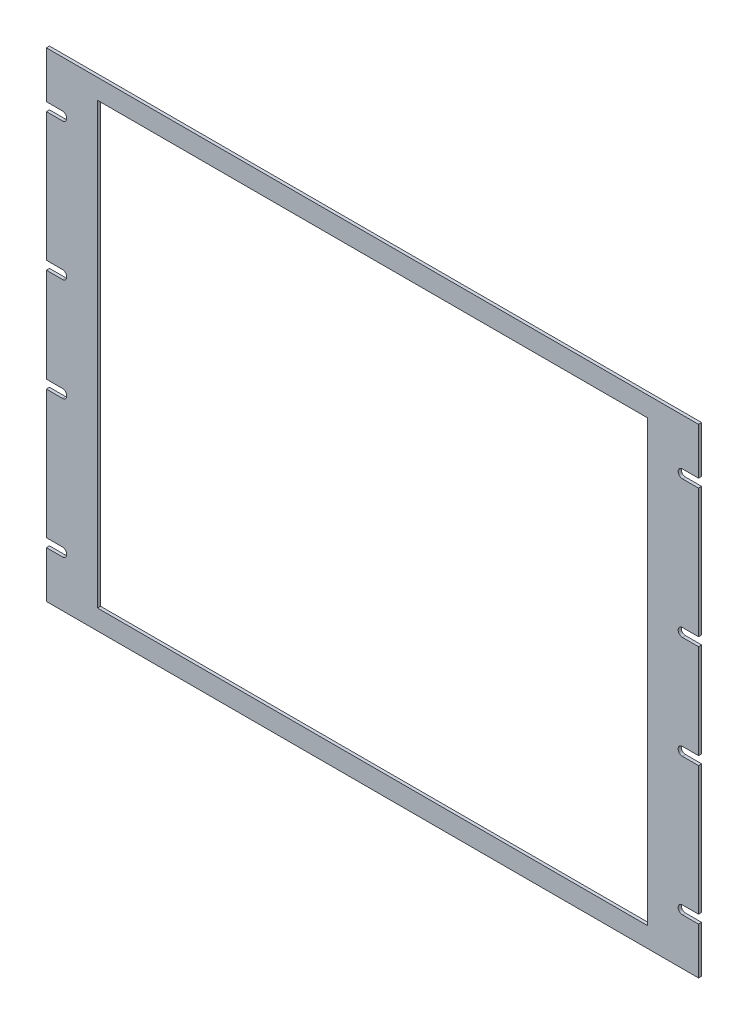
ISO-10303-21;
HEADER;
FILE_DESCRIPTION(('STEP AP214'),'2;1');
FILE_NAME('part.step','',(''),(''),'','','');
FILE_SCHEMA(('AUTOMOTIVE_DESIGN { 1 0 10303 214 1 1 1 1 }'));
ENDSEC;
DATA;
#1=APPLICATION_CONTEXT('core data for automotive mechanical design processes');
#2=APPLICATION_PROTOCOL_DEFINITION('international standard','automotive_design',2000,#1);
#3=PRODUCT_CONTEXT('',#1,'mechanical');
#4=PRODUCT('Part','Part','',(#3));
#5=PRODUCT_RELATED_PRODUCT_CATEGORY('part','',(#4));
#6=PRODUCT_DEFINITION_FORMATION('','',#4);
#7=PRODUCT_DEFINITION_CONTEXT('part definition',#1,'design');
#8=PRODUCT_DEFINITION('design','',#6,#7);
#9=PRODUCT_DEFINITION_SHAPE('','',#8);
#10=(LENGTH_UNIT() NAMED_UNIT(*) SI_UNIT(.MILLI.,.METRE.));
#11=(NAMED_UNIT(*) PLANE_ANGLE_UNIT() SI_UNIT($,.RADIAN.));
#12=(NAMED_UNIT(*) SI_UNIT($,.STERADIAN.) SOLID_ANGLE_UNIT());
#13=UNCERTAINTY_MEASURE_WITH_UNIT(LENGTH_MEASURE(1.E-05),#10,'distance_accuracy_value','');
#14=(GEOMETRIC_REPRESENTATION_CONTEXT(3) GLOBAL_UNCERTAINTY_ASSIGNED_CONTEXT((#13)) GLOBAL_UNIT_ASSIGNED_CONTEXT((#10,
#11,#12)) REPRESENTATION_CONTEXT('',''));
#15=CARTESIAN_POINT('',(0.,0.,0.));
#16=DIRECTION('',(0.,0.,1.));
#17=DIRECTION('',(1.,0.,0.));
#18=AXIS2_PLACEMENT_3D('',#15,#16,#17);
#19=CARTESIAN_POINT('',(229.3874,139.7,2.286));
#20=DIRECTION('',(0.,0.,1.));
#21=DIRECTION('',(1.,0.,0.));
#22=AXIS2_PLACEMENT_3D('',#19,#20,#21);
#23=PLANE('',#22);
#24=CARTESIAN_POINT('',(229.3874,139.7,2.286));
#25=DIRECTION('',(0.,0.,-1.));
#26=DIRECTION('',(1.,0.,0.));
#27=AXIS2_PLACEMENT_3D('',#24,#25,#26);
#28=CIRCLE('',#27,3.17499999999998);
#29=CARTESIAN_POINT('',(229.3874,136.525,2.286));
#30=VERTEX_POINT('',#29);
#31=CARTESIAN_POINT('',(229.3874,142.875,2.286));
#32=VERTEX_POINT('',#31);
#33=EDGE_CURVE('E326',#30,#32,#28,.T.);
#34=ORIENTED_EDGE('',*,*,#33,.T.);
#35=DIRECTION('',(1.,0.,0.));
#36=VECTOR('',#35,1.);
#37=CARTESIAN_POINT('',(241.3,142.875,2.286));
#38=LINE('',#37,#36);
#39=CARTESIAN_POINT('',(241.3,142.875,2.286));
#40=VERTEX_POINT('',#39);
#41=EDGE_CURVE('E329',#32,#40,#38,.T.);
#42=ORIENTED_EDGE('',*,*,#41,.T.);
#43=DIRECTION('',(0.,1.,0.));
#44=VECTOR('',#43,1.);
#45=CARTESIAN_POINT('',(241.3,177.419,2.286));
#46=LINE('',#45,#44);
#47=CARTESIAN_POINT('',(241.3,177.419,2.286));
#48=VERTEX_POINT('',#47);
#49=EDGE_CURVE('E332',#40,#48,#46,.T.);
#50=ORIENTED_EDGE('',*,*,#49,.T.);
#51=DIRECTION('',(-1.,0.,0.));
#52=VECTOR('',#51,1.);
#53=CARTESIAN_POINT('',(241.3,177.419,2.286));
#54=LINE('',#53,#52);
#55=CARTESIAN_POINT('',(-241.3,177.419,2.286));
#56=VERTEX_POINT('',#55);
#57=EDGE_CURVE('E334',#48,#56,#54,.T.);
#58=ORIENTED_EDGE('',*,*,#57,.T.);
#59=DIRECTION('',(0.,-1.,0.));
#60=VECTOR('',#59,1.);
#61=CARTESIAN_POINT('',(-241.3,177.419,2.286));
#62=LINE('',#61,#60);
#63=CARTESIAN_POINT('',(-241.3,142.875,2.286));
#64=VERTEX_POINT('',#63);
#65=EDGE_CURVE('E336',#56,#64,#62,.T.);
#66=ORIENTED_EDGE('',*,*,#65,.T.);
#67=DIRECTION('',(1.,0.,0.));
#68=VECTOR('',#67,1.);
#69=CARTESIAN_POINT('',(-241.3,142.875,2.286));
#70=LINE('',#69,#68);
#71=CARTESIAN_POINT('',(-229.3874,142.875,2.286));
#72=VERTEX_POINT('',#71);
#73=EDGE_CURVE('E338',#64,#72,#70,.T.);
#74=ORIENTED_EDGE('',*,*,#73,.T.);
#75=CARTESIAN_POINT('',(-229.3874,139.7,2.286));
#76=DIRECTION('',(0.,0.,-1.));
#77=DIRECTION('',(1.,0.,0.));
#78=AXIS2_PLACEMENT_3D('',#75,#76,#77);
#79=CIRCLE('',#78,3.17499999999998);
#80=CARTESIAN_POINT('',(-229.3874,136.525,2.286));
#81=VERTEX_POINT('',#80);
#82=EDGE_CURVE('E340',#72,#81,#79,.T.);
#83=ORIENTED_EDGE('',*,*,#82,.T.);
#84=DIRECTION('',(-1.,0.,0.));
#85=VECTOR('',#84,1.);
#86=CARTESIAN_POINT('',(-241.3,136.525,2.286));
#87=LINE('',#86,#85);
#88=CARTESIAN_POINT('',(-241.3,136.525,2.286));
#89=VERTEX_POINT('',#88);
#90=EDGE_CURVE('E342',#81,#89,#87,.T.);
#91=ORIENTED_EDGE('',*,*,#90,.T.);
#92=DIRECTION('',(0.,-1.,0.));
#93=VECTOR('',#92,1.);
#94=CARTESIAN_POINT('',(-241.3,136.525,2.286));
#95=LINE('',#94,#93);
#96=CARTESIAN_POINT('',(-241.3,41.2749746,2.286));
#97=VERTEX_POINT('',#96);
#98=EDGE_CURVE('E344',#89,#97,#95,.T.);
#99=ORIENTED_EDGE('',*,*,#98,.T.);
#100=DIRECTION('',(1.,0.,0.));
#101=VECTOR('',#100,1.);
#102=CARTESIAN_POINT('',(-241.3,41.2749746,2.286));
#103=LINE('',#102,#101);
#104=CARTESIAN_POINT('',(-229.3874,41.2749746,2.286));
#105=VERTEX_POINT('',#104);
#106=EDGE_CURVE('E346',#97,#105,#103,.T.);
#107=ORIENTED_EDGE('',*,*,#106,.T.);
#108=CARTESIAN_POINT('',(-229.3874,38.0999746,2.286));
#109=DIRECTION('',(0.,0.,-1.));
#110=DIRECTION('',(1.,0.,0.));
#111=AXIS2_PLACEMENT_3D('',#108,#109,#110);
#112=CIRCLE('',#111,3.175);
#113=CARTESIAN_POINT('',(-229.3874,34.9249746,2.286));
#114=VERTEX_POINT('',#113);
#115=EDGE_CURVE('E348',#105,#114,#112,.T.);
#116=ORIENTED_EDGE('',*,*,#115,.T.);
#117=DIRECTION('',(-1.,0.,0.));
#118=VECTOR('',#117,1.);
#119=CARTESIAN_POINT('',(-241.3,34.9249746,2.286));
#120=LINE('',#119,#118);
#121=CARTESIAN_POINT('',(-241.3,34.9249746,2.286));
#122=VERTEX_POINT('',#121);
#123=EDGE_CURVE('E350',#114,#122,#120,.T.);
#124=ORIENTED_EDGE('',*,*,#123,.T.);
#125=DIRECTION('',(0.,-1.,0.));
#126=VECTOR('',#125,1.);
#127=CARTESIAN_POINT('',(-241.3,34.9249746,2.286));
#128=LINE('',#127,#126);
#129=CARTESIAN_POINT('',(-241.3,-34.925,2.286));
#130=VERTEX_POINT('',#129);
#131=EDGE_CURVE('E352',#122,#130,#128,.T.);
#132=ORIENTED_EDGE('',*,*,#131,.T.);
#133=DIRECTION('',(1.,0.,0.));
#134=VECTOR('',#133,1.);
#135=CARTESIAN_POINT('',(-241.3,-34.925,2.286));
#136=LINE('',#135,#134);
#137=CARTESIAN_POINT('',(-229.3874,-34.925,2.286));
#138=VERTEX_POINT('',#137);
#139=EDGE_CURVE('E354',#130,#138,#136,.T.);
#140=ORIENTED_EDGE('',*,*,#139,.T.);
#141=CARTESIAN_POINT('',(-229.3874,-38.1,2.286));
#142=DIRECTION('',(0.,0.,-1.));
#143=DIRECTION('',(1.,0.,0.));
#144=AXIS2_PLACEMENT_3D('',#141,#142,#143);
#145=CIRCLE('',#144,3.175);
#146=CARTESIAN_POINT('',(-229.3874,-41.275,2.286));
#147=VERTEX_POINT('',#146);
#148=EDGE_CURVE('E356',#138,#147,#145,.T.);
#149=ORIENTED_EDGE('',*,*,#148,.T.);
#150=DIRECTION('',(-1.,0.,0.));
#151=VECTOR('',#150,1.);
#152=CARTESIAN_POINT('',(-241.3,-41.275,2.286));
#153=LINE('',#152,#151);
#154=CARTESIAN_POINT('',(-241.3,-41.275,2.286));
#155=VERTEX_POINT('',#154);
#156=EDGE_CURVE('E358',#147,#155,#153,.T.);
#157=ORIENTED_EDGE('',*,*,#156,.T.);
#158=DIRECTION('',(0.,-1.,0.));
#159=VECTOR('',#158,1.);
#160=CARTESIAN_POINT('',(-241.3,-41.275,2.286));
#161=LINE('',#160,#159);
#162=CARTESIAN_POINT('',(-241.3,-136.525,2.286));
#163=VERTEX_POINT('',#162);
#164=EDGE_CURVE('E360',#155,#163,#161,.T.);
#165=ORIENTED_EDGE('',*,*,#164,.T.);
#166=DIRECTION('',(1.,0.,0.));
#167=VECTOR('',#166,1.);
#168=CARTESIAN_POINT('',(-241.3,-136.525,2.286));
#169=LINE('',#168,#167);
#170=CARTESIAN_POINT('',(-229.3874,-136.525,2.286));
#171=VERTEX_POINT('',#170);
#172=EDGE_CURVE('E362',#163,#171,#169,.T.);
#173=ORIENTED_EDGE('',*,*,#172,.T.);
#174=CARTESIAN_POINT('',(-229.3874,-139.7,2.286));
#175=DIRECTION('',(0.,0.,-1.));
#176=DIRECTION('',(1.,0.,0.));
#177=AXIS2_PLACEMENT_3D('',#174,#175,#176);
#178=CIRCLE('',#177,3.17500000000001);
#179=CARTESIAN_POINT('',(-229.3874,-142.875,2.286));
#180=VERTEX_POINT('',#179);
#181=EDGE_CURVE('E364',#171,#180,#178,.T.);
#182=ORIENTED_EDGE('',*,*,#181,.T.);
#183=DIRECTION('',(-1.,0.,0.));
#184=VECTOR('',#183,1.);
#185=CARTESIAN_POINT('',(-241.3,-142.875,2.286));
#186=LINE('',#185,#184);
#187=CARTESIAN_POINT('',(-241.3,-142.875,2.286));
#188=VERTEX_POINT('',#187);
#189=EDGE_CURVE('E366',#180,#188,#186,.T.);
#190=ORIENTED_EDGE('',*,*,#189,.T.);
#191=DIRECTION('',(0.,-1.,0.));
#192=VECTOR('',#191,1.);
#193=CARTESIAN_POINT('',(-241.3,-177.3936,2.286));
#194=LINE('',#193,#192);
#195=CARTESIAN_POINT('',(-241.3,-177.3936,2.286));
#196=VERTEX_POINT('',#195);
#197=EDGE_CURVE('E368',#188,#196,#194,.T.);
#198=ORIENTED_EDGE('',*,*,#197,.T.);
#199=DIRECTION('',(1.,0.,0.));
#200=VECTOR('',#199,1.);
#201=CARTESIAN_POINT('',(241.3,-177.3936,2.286));
#202=LINE('',#201,#200);
#203=CARTESIAN_POINT('',(241.3,-177.3936,2.286));
#204=VERTEX_POINT('',#203);
#205=EDGE_CURVE('E370',#196,#204,#202,.T.);
#206=ORIENTED_EDGE('',*,*,#205,.T.);
#207=DIRECTION('',(0.,1.,0.));
#208=VECTOR('',#207,1.);
#209=CARTESIAN_POINT('',(241.3,-177.3936,2.286));
#210=LINE('',#209,#208);
#211=CARTESIAN_POINT('',(241.3,-142.875,2.286));
#212=VERTEX_POINT('',#211);
#213=EDGE_CURVE('E372',#204,#212,#210,.T.);
#214=ORIENTED_EDGE('',*,*,#213,.T.);
#215=DIRECTION('',(-1.,0.,0.));
#216=VECTOR('',#215,1.);
#217=CARTESIAN_POINT('',(241.3,-142.875,2.286));
#218=LINE('',#217,#216);
#219=CARTESIAN_POINT('',(229.3874,-142.875,2.286));
#220=VERTEX_POINT('',#219);
#221=EDGE_CURVE('E374',#212,#220,#218,.T.);
#222=ORIENTED_EDGE('',*,*,#221,.T.);
#223=CARTESIAN_POINT('',(229.3874,-139.7,2.286));
#224=DIRECTION('',(0.,0.,-1.));
#225=DIRECTION('',(1.,0.,0.));
#226=AXIS2_PLACEMENT_3D('',#223,#224,#225);
#227=CIRCLE('',#226,3.17500000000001);
#228=CARTESIAN_POINT('',(229.3874,-136.525,2.286));
#229=VERTEX_POINT('',#228);
#230=EDGE_CURVE('E376',#220,#229,#227,.T.);
#231=ORIENTED_EDGE('',*,*,#230,.T.);
#232=DIRECTION('',(1.,0.,0.));
#233=VECTOR('',#232,1.);
#234=CARTESIAN_POINT('',(241.3,-136.525,2.286));
#235=LINE('',#234,#233);
#236=CARTESIAN_POINT('',(241.3,-136.525,2.286));
#237=VERTEX_POINT('',#236);
#238=EDGE_CURVE('E378',#229,#237,#235,.T.);
#239=ORIENTED_EDGE('',*,*,#238,.T.);
#240=DIRECTION('',(0.,1.,0.));
#241=VECTOR('',#240,1.);
#242=CARTESIAN_POINT('',(241.3,-136.525,2.286));
#243=LINE('',#242,#241);
#244=CARTESIAN_POINT('',(241.3,-41.275,2.286));
#245=VERTEX_POINT('',#244);
#246=EDGE_CURVE('E380',#237,#245,#243,.T.);
#247=ORIENTED_EDGE('',*,*,#246,.T.);
#248=DIRECTION('',(-1.,0.,0.));
#249=VECTOR('',#248,1.);
#250=CARTESIAN_POINT('',(241.3,-41.275,2.286));
#251=LINE('',#250,#249);
#252=CARTESIAN_POINT('',(229.3874,-41.275,2.286));
#253=VERTEX_POINT('',#252);
#254=EDGE_CURVE('E382',#245,#253,#251,.T.);
#255=ORIENTED_EDGE('',*,*,#254,.T.);
#256=CARTESIAN_POINT('',(229.3874,-38.1,2.286));
#257=DIRECTION('',(0.,0.,-1.));
#258=DIRECTION('',(1.,0.,0.));
#259=AXIS2_PLACEMENT_3D('',#256,#257,#258);
#260=CIRCLE('',#259,3.175);
#261=CARTESIAN_POINT('',(229.3874,-34.925,2.286));
#262=VERTEX_POINT('',#261);
#263=EDGE_CURVE('E384',#253,#262,#260,.T.);
#264=ORIENTED_EDGE('',*,*,#263,.T.);
#265=DIRECTION('',(1.,0.,0.));
#266=VECTOR('',#265,1.);
#267=CARTESIAN_POINT('',(241.3,-34.925,2.286));
#268=LINE('',#267,#266);
#269=CARTESIAN_POINT('',(241.3,-34.925,2.286));
#270=VERTEX_POINT('',#269);
#271=EDGE_CURVE('E386',#262,#270,#268,.T.);
#272=ORIENTED_EDGE('',*,*,#271,.T.);
#273=DIRECTION('',(0.,1.,0.));
#274=VECTOR('',#273,1.);
#275=CARTESIAN_POINT('',(241.3,-34.925,2.286));
#276=LINE('',#275,#274);
#277=CARTESIAN_POINT('',(241.3,34.9249746,2.286));
#278=VERTEX_POINT('',#277);
#279=EDGE_CURVE('E388',#270,#278,#276,.T.);
#280=ORIENTED_EDGE('',*,*,#279,.T.);
#281=DIRECTION('',(-1.,0.,0.));
#282=VECTOR('',#281,1.);
#283=CARTESIAN_POINT('',(241.3,34.9249746,2.286));
#284=LINE('',#283,#282);
#285=CARTESIAN_POINT('',(229.3874,34.9249746,2.286));
#286=VERTEX_POINT('',#285);
#287=EDGE_CURVE('E390',#278,#286,#284,.T.);
#288=ORIENTED_EDGE('',*,*,#287,.T.);
#289=CARTESIAN_POINT('',(229.3874,38.0999746,2.286));
#290=DIRECTION('',(0.,0.,-1.));
#291=DIRECTION('',(1.,0.,0.));
#292=AXIS2_PLACEMENT_3D('',#289,#290,#291);
#293=CIRCLE('',#292,3.175);
#294=CARTESIAN_POINT('',(229.3874,41.2749746,2.286));
#295=VERTEX_POINT('',#294);
#296=EDGE_CURVE('E392',#286,#295,#293,.T.);
#297=ORIENTED_EDGE('',*,*,#296,.T.);
#298=DIRECTION('',(1.,0.,0.));
#299=VECTOR('',#298,1.);
#300=CARTESIAN_POINT('',(241.3,41.2749746,2.286));
#301=LINE('',#300,#299);
#302=CARTESIAN_POINT('',(241.3,41.2749746,2.286));
#303=VERTEX_POINT('',#302);
#304=EDGE_CURVE('E394',#295,#303,#301,.T.);
#305=ORIENTED_EDGE('',*,*,#304,.T.);
#306=DIRECTION('',(0.,1.,0.));
#307=VECTOR('',#306,1.);
#308=CARTESIAN_POINT('',(241.3,41.2749746,2.286));
#309=LINE('',#308,#307);
#310=CARTESIAN_POINT('',(241.3,136.525,2.286));
#311=VERTEX_POINT('',#310);
#312=EDGE_CURVE('E396',#303,#311,#309,.T.);
#313=ORIENTED_EDGE('',*,*,#312,.T.);
#314=DIRECTION('',(-1.,0.,0.));
#315=VECTOR('',#314,1.);
#316=CARTESIAN_POINT('',(241.3,136.525,2.286));
#317=LINE('',#316,#315);
#318=EDGE_CURVE('E398',#311,#30,#317,.T.);
#319=ORIENTED_EDGE('',*,*,#318,.T.);
#320=EDGE_LOOP('',(#34,#42,#50,#58,#66,#74,#83,#91,#99,#107,#116,#124,#132,#140,#149,#157,#165,
#173,#182,#190,#198,#206,#214,#222,#231,#239,#247,#255,#264,#272,#280,#288,#297,#305,#313,#319));
#321=FACE_BOUND('',#320,.T.);
#322=DIRECTION('',(-1.,0.,0.));
#323=VECTOR('',#322,1.);
#324=CARTESIAN_POINT('',(203.454,162.687,2.286));
#325=LINE('',#324,#323);
#326=CARTESIAN_POINT('',(203.454,162.687,2.286));
#327=VERTEX_POINT('',#326);
#328=CARTESIAN_POINT('',(-203.454,162.687,2.286));
#329=VERTEX_POINT('',#328);
#330=EDGE_CURVE('E298',#327,#329,#325,.T.);
#331=ORIENTED_EDGE('',*,*,#330,.F.);
#332=DIRECTION('',(0.,1.,0.));
#333=VECTOR('',#332,1.);
#334=CARTESIAN_POINT('',(203.454,162.687,2.286));
#335=LINE('',#334,#333);
#336=CARTESIAN_POINT('',(203.454,-162.687,2.286));
#337=VERTEX_POINT('',#336);
#338=EDGE_CURVE('E290',#337,#327,#335,.T.);
#339=ORIENTED_EDGE('',*,*,#338,.F.);
#340=DIRECTION('',(1.,0.,0.));
#341=VECTOR('',#340,1.);
#342=CARTESIAN_POINT('',(203.454,-162.687,2.286));
#343=LINE('',#342,#341);
#344=CARTESIAN_POINT('',(-203.454,-162.687,2.286));
#345=VERTEX_POINT('',#344);
#346=EDGE_CURVE('E312',#345,#337,#343,.T.);
#347=ORIENTED_EDGE('',*,*,#346,.F.);
#348=DIRECTION('',(0.,-1.,0.));
#349=VECTOR('',#348,1.);
#350=CARTESIAN_POINT('',(-203.454,162.687,2.286));
#351=LINE('',#350,#349);
#352=EDGE_CURVE('E310',#329,#345,#351,.T.);
#353=ORIENTED_EDGE('',*,*,#352,.F.);
#354=EDGE_LOOP('',(#331,#339,#347,#353));
#355=FACE_BOUND('',#354,.T.);
#356=ADVANCED_FACE('F33',(#321,#355),#23,.T.);
#357=CARTESIAN_POINT('',(229.3874,139.7,0.));
#358=DIRECTION('',(0.,0.,1.));
#359=DIRECTION('',(1.,0.,0.));
#360=AXIS2_PLACEMENT_3D('',#357,#358,#359);
#361=PLANE('',#360);
#362=CARTESIAN_POINT('',(229.3874,139.7,0.));
#363=DIRECTION('',(0.,0.,-1.));
#364=DIRECTION('',(1.,0.,0.));
#365=AXIS2_PLACEMENT_3D('',#362,#363,#364);
#366=CIRCLE('',#365,3.17499999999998);
#367=CARTESIAN_POINT('',(229.3874,136.525,0.));
#368=VERTEX_POINT('',#367);
#369=CARTESIAN_POINT('',(229.3874,142.875,0.));
#370=VERTEX_POINT('',#369);
#371=EDGE_CURVE('E306',#368,#370,#366,.T.);
#372=ORIENTED_EDGE('',*,*,#371,.F.);
#373=DIRECTION('',(-1.,0.,0.));
#374=VECTOR('',#373,1.);
#375=CARTESIAN_POINT('',(241.3,136.525,0.));
#376=LINE('',#375,#374);
#377=CARTESIAN_POINT('',(241.3,136.525,0.));
#378=VERTEX_POINT('',#377);
#379=EDGE_CURVE('E330',#378,#368,#376,.T.);
#380=ORIENTED_EDGE('',*,*,#379,.F.);
#381=DIRECTION('',(0.,1.,0.));
#382=VECTOR('',#381,1.);
#383=CARTESIAN_POINT('',(241.3,41.2749746,0.));
#384=LINE('',#383,#382);
#385=CARTESIAN_POINT('',(241.3,41.2749746,0.));
#386=VERTEX_POINT('',#385);
#387=EDGE_CURVE('E469',#386,#378,#384,.T.);
#388=ORIENTED_EDGE('',*,*,#387,.F.);
#389=DIRECTION('',(1.,0.,0.));
#390=VECTOR('',#389,1.);
#391=CARTESIAN_POINT('',(241.3,41.2749746,0.));
#392=LINE('',#391,#390);
#393=CARTESIAN_POINT('',(229.3874,41.2749746,0.));
#394=VERTEX_POINT('',#393);
#395=EDGE_CURVE('E467',#394,#386,#392,.T.);
#396=ORIENTED_EDGE('',*,*,#395,.F.);
#397=CARTESIAN_POINT('',(229.3874,38.0999746,0.));
#398=DIRECTION('',(0.,0.,-1.));
#399=DIRECTION('',(1.,0.,0.));
#400=AXIS2_PLACEMENT_3D('',#397,#398,#399);
#401=CIRCLE('',#400,3.175);
#402=CARTESIAN_POINT('',(229.3874,34.9249746,0.));
#403=VERTEX_POINT('',#402);
#404=EDGE_CURVE('E465',#403,#394,#401,.T.);
#405=ORIENTED_EDGE('',*,*,#404,.F.);
#406=DIRECTION('',(-1.,0.,0.));
#407=VECTOR('',#406,1.);
#408=CARTESIAN_POINT('',(241.3,34.9249746,0.));
#409=LINE('',#408,#407);
#410=CARTESIAN_POINT('',(241.3,34.9249746,0.));
#411=VERTEX_POINT('',#410);
#412=EDGE_CURVE('E463',#411,#403,#409,.T.);
#413=ORIENTED_EDGE('',*,*,#412,.F.);
#414=DIRECTION('',(0.,1.,0.));
#415=VECTOR('',#414,1.);
#416=CARTESIAN_POINT('',(241.3,-34.925,0.));
#417=LINE('',#416,#415);
#418=CARTESIAN_POINT('',(241.3,-34.925,0.));
#419=VERTEX_POINT('',#418);
#420=EDGE_CURVE('E461',#419,#411,#417,.T.);
#421=ORIENTED_EDGE('',*,*,#420,.F.);
#422=DIRECTION('',(1.,0.,0.));
#423=VECTOR('',#422,1.);
#424=CARTESIAN_POINT('',(241.3,-34.925,0.));
#425=LINE('',#424,#423);
#426=CARTESIAN_POINT('',(229.3874,-34.925,0.));
#427=VERTEX_POINT('',#426);
#428=EDGE_CURVE('E459',#427,#419,#425,.T.);
#429=ORIENTED_EDGE('',*,*,#428,.F.);
#430=CARTESIAN_POINT('',(229.3874,-38.1,0.));
#431=DIRECTION('',(0.,0.,-1.));
#432=DIRECTION('',(1.,0.,0.));
#433=AXIS2_PLACEMENT_3D('',#430,#431,#432);
#434=CIRCLE('',#433,3.175);
#435=CARTESIAN_POINT('',(229.3874,-41.275,0.));
#436=VERTEX_POINT('',#435);
#437=EDGE_CURVE('E457',#436,#427,#434,.T.);
#438=ORIENTED_EDGE('',*,*,#437,.F.);
#439=DIRECTION('',(-1.,0.,0.));
#440=VECTOR('',#439,1.);
#441=CARTESIAN_POINT('',(241.3,-41.275,0.));
#442=LINE('',#441,#440);
#443=CARTESIAN_POINT('',(241.3,-41.275,0.));
#444=VERTEX_POINT('',#443);
#445=EDGE_CURVE('E455',#444,#436,#442,.T.);
#446=ORIENTED_EDGE('',*,*,#445,.F.);
#447=DIRECTION('',(0.,1.,0.));
#448=VECTOR('',#447,1.);
#449=CARTESIAN_POINT('',(241.3,-136.525,0.));
#450=LINE('',#449,#448);
#451=CARTESIAN_POINT('',(241.3,-136.525,0.));
#452=VERTEX_POINT('',#451);
#453=EDGE_CURVE('E453',#452,#444,#450,.T.);
#454=ORIENTED_EDGE('',*,*,#453,.F.);
#455=DIRECTION('',(1.,0.,0.));
#456=VECTOR('',#455,1.);
#457=CARTESIAN_POINT('',(241.3,-136.525,0.));
#458=LINE('',#457,#456);
#459=CARTESIAN_POINT('',(229.3874,-136.525,0.));
#460=VERTEX_POINT('',#459);
#461=EDGE_CURVE('E451',#460,#452,#458,.T.);
#462=ORIENTED_EDGE('',*,*,#461,.F.);
#463=CARTESIAN_POINT('',(229.3874,-139.7,0.));
#464=DIRECTION('',(0.,0.,-1.));
#465=DIRECTION('',(1.,0.,0.));
#466=AXIS2_PLACEMENT_3D('',#463,#464,#465);
#467=CIRCLE('',#466,3.17500000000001);
#468=CARTESIAN_POINT('',(229.3874,-142.875,0.));
#469=VERTEX_POINT('',#468);
#470=EDGE_CURVE('E449',#469,#460,#467,.T.);
#471=ORIENTED_EDGE('',*,*,#470,.F.);
#472=DIRECTION('',(-1.,0.,0.));
#473=VECTOR('',#472,1.);
#474=CARTESIAN_POINT('',(241.3,-142.875,0.));
#475=LINE('',#474,#473);
#476=CARTESIAN_POINT('',(241.3,-142.875,0.));
#477=VERTEX_POINT('',#476);
#478=EDGE_CURVE('E447',#477,#469,#475,.T.);
#479=ORIENTED_EDGE('',*,*,#478,.F.);
#480=DIRECTION('',(0.,1.,0.));
#481=VECTOR('',#480,1.);
#482=CARTESIAN_POINT('',(241.3,-177.3936,0.));
#483=LINE('',#482,#481);
#484=CARTESIAN_POINT('',(241.3,-177.3936,0.));
#485=VERTEX_POINT('',#484);
#486=EDGE_CURVE('E445',#485,#477,#483,.T.);
#487=ORIENTED_EDGE('',*,*,#486,.F.);
#488=DIRECTION('',(1.,0.,0.));
#489=VECTOR('',#488,1.);
#490=CARTESIAN_POINT('',(241.3,-177.3936,0.));
#491=LINE('',#490,#489);
#492=CARTESIAN_POINT('',(-241.3,-177.3936,0.));
#493=VERTEX_POINT('',#492);
#494=EDGE_CURVE('E443',#493,#485,#491,.T.);
#495=ORIENTED_EDGE('',*,*,#494,.F.);
#496=DIRECTION('',(0.,-1.,0.));
#497=VECTOR('',#496,1.);
#498=CARTESIAN_POINT('',(-241.3,-177.3936,0.));
#499=LINE('',#498,#497);
#500=CARTESIAN_POINT('',(-241.3,-142.875,0.));
#501=VERTEX_POINT('',#500);
#502=EDGE_CURVE('E441',#501,#493,#499,.T.);
#503=ORIENTED_EDGE('',*,*,#502,.F.);
#504=DIRECTION('',(-1.,0.,0.));
#505=VECTOR('',#504,1.);
#506=CARTESIAN_POINT('',(-241.3,-142.875,0.));
#507=LINE('',#506,#505);
#508=CARTESIAN_POINT('',(-229.3874,-142.875,0.));
#509=VERTEX_POINT('',#508);
#510=EDGE_CURVE('E439',#509,#501,#507,.T.);
#511=ORIENTED_EDGE('',*,*,#510,.F.);
#512=CARTESIAN_POINT('',(-229.3874,-139.7,0.));
#513=DIRECTION('',(0.,0.,-1.));
#514=DIRECTION('',(1.,0.,0.));
#515=AXIS2_PLACEMENT_3D('',#512,#513,#514);
#516=CIRCLE('',#515,3.17500000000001);
#517=CARTESIAN_POINT('',(-229.3874,-136.525,0.));
#518=VERTEX_POINT('',#517);
#519=EDGE_CURVE('E437',#518,#509,#516,.T.);
#520=ORIENTED_EDGE('',*,*,#519,.F.);
#521=DIRECTION('',(1.,0.,0.));
#522=VECTOR('',#521,1.);
#523=CARTESIAN_POINT('',(-241.3,-136.525,0.));
#524=LINE('',#523,#522);
#525=CARTESIAN_POINT('',(-241.3,-136.525,0.));
#526=VERTEX_POINT('',#525);
#527=EDGE_CURVE('E435',#526,#518,#524,.T.);
#528=ORIENTED_EDGE('',*,*,#527,.F.);
#529=DIRECTION('',(0.,-1.,0.));
#530=VECTOR('',#529,1.);
#531=CARTESIAN_POINT('',(-241.3,-41.275,0.));
#532=LINE('',#531,#530);
#533=CARTESIAN_POINT('',(-241.3,-41.275,0.));
#534=VERTEX_POINT('',#533);
#535=EDGE_CURVE('E433',#534,#526,#532,.T.);
#536=ORIENTED_EDGE('',*,*,#535,.F.);
#537=DIRECTION('',(-1.,0.,0.));
#538=VECTOR('',#537,1.);
#539=CARTESIAN_POINT('',(-241.3,-41.275,0.));
#540=LINE('',#539,#538);
#541=CARTESIAN_POINT('',(-229.3874,-41.275,0.));
#542=VERTEX_POINT('',#541);
#543=EDGE_CURVE('E431',#542,#534,#540,.T.);
#544=ORIENTED_EDGE('',*,*,#543,.F.);
#545=CARTESIAN_POINT('',(-229.3874,-38.1,0.));
#546=DIRECTION('',(0.,0.,-1.));
#547=DIRECTION('',(1.,0.,0.));
#548=AXIS2_PLACEMENT_3D('',#545,#546,#547);
#549=CIRCLE('',#548,3.175);
#550=CARTESIAN_POINT('',(-229.3874,-34.925,0.));
#551=VERTEX_POINT('',#550);
#552=EDGE_CURVE('E429',#551,#542,#549,.T.);
#553=ORIENTED_EDGE('',*,*,#552,.F.);
#554=DIRECTION('',(1.,0.,0.));
#555=VECTOR('',#554,1.);
#556=CARTESIAN_POINT('',(-241.3,-34.925,0.));
#557=LINE('',#556,#555);
#558=CARTESIAN_POINT('',(-241.3,-34.925,0.));
#559=VERTEX_POINT('',#558);
#560=EDGE_CURVE('E427',#559,#551,#557,.T.);
#561=ORIENTED_EDGE('',*,*,#560,.F.);
#562=DIRECTION('',(0.,-1.,0.));
#563=VECTOR('',#562,1.);
#564=CARTESIAN_POINT('',(-241.3,34.9249746,0.));
#565=LINE('',#564,#563);
#566=CARTESIAN_POINT('',(-241.3,34.9249746,0.));
#567=VERTEX_POINT('',#566);
#568=EDGE_CURVE('E425',#567,#559,#565,.T.);
#569=ORIENTED_EDGE('',*,*,#568,.F.);
#570=DIRECTION('',(-1.,0.,0.));
#571=VECTOR('',#570,1.);
#572=CARTESIAN_POINT('',(-241.3,34.9249746,0.));
#573=LINE('',#572,#571);
#574=CARTESIAN_POINT('',(-229.3874,34.9249746,0.));
#575=VERTEX_POINT('',#574);
#576=EDGE_CURVE('E423',#575,#567,#573,.T.);
#577=ORIENTED_EDGE('',*,*,#576,.F.);
#578=CARTESIAN_POINT('',(-229.3874,38.0999746,0.));
#579=DIRECTION('',(0.,0.,-1.));
#580=DIRECTION('',(1.,0.,0.));
#581=AXIS2_PLACEMENT_3D('',#578,#579,#580);
#582=CIRCLE('',#581,3.175);
#583=CARTESIAN_POINT('',(-229.3874,41.2749746,0.));
#584=VERTEX_POINT('',#583);
#585=EDGE_CURVE('E421',#584,#575,#582,.T.);
#586=ORIENTED_EDGE('',*,*,#585,.F.);
#587=DIRECTION('',(1.,0.,0.));
#588=VECTOR('',#587,1.);
#589=CARTESIAN_POINT('',(-241.3,41.2749746,0.));
#590=LINE('',#589,#588);
#591=CARTESIAN_POINT('',(-241.3,41.2749746,0.));
#592=VERTEX_POINT('',#591);
#593=EDGE_CURVE('E419',#592,#584,#590,.T.);
#594=ORIENTED_EDGE('',*,*,#593,.F.);
#595=DIRECTION('',(0.,-1.,0.));
#596=VECTOR('',#595,1.);
#597=CARTESIAN_POINT('',(-241.3,136.525,0.));
#598=LINE('',#597,#596);
#599=CARTESIAN_POINT('',(-241.3,136.525,0.));
#600=VERTEX_POINT('',#599);
#601=EDGE_CURVE('E417',#600,#592,#598,.T.);
#602=ORIENTED_EDGE('',*,*,#601,.F.);
#603=DIRECTION('',(-1.,0.,0.));
#604=VECTOR('',#603,1.);
#605=CARTESIAN_POINT('',(-241.3,136.525,0.));
#606=LINE('',#605,#604);
#607=CARTESIAN_POINT('',(-229.3874,136.525,0.));
#608=VERTEX_POINT('',#607);
#609=EDGE_CURVE('E415',#608,#600,#606,.T.);
#610=ORIENTED_EDGE('',*,*,#609,.F.);
#611=CARTESIAN_POINT('',(-229.3874,139.7,0.));
#612=DIRECTION('',(0.,0.,-1.));
#613=DIRECTION('',(1.,0.,0.));
#614=AXIS2_PLACEMENT_3D('',#611,#612,#613);
#615=CIRCLE('',#614,3.17499999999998);
#616=CARTESIAN_POINT('',(-229.3874,142.875,0.));
#617=VERTEX_POINT('',#616);
#618=EDGE_CURVE('E413',#617,#608,#615,.T.);
#619=ORIENTED_EDGE('',*,*,#618,.F.);
#620=DIRECTION('',(1.,0.,0.));
#621=VECTOR('',#620,1.);
#622=CARTESIAN_POINT('',(-241.3,142.875,0.));
#623=LINE('',#622,#621);
#624=CARTESIAN_POINT('',(-241.3,142.875,0.));
#625=VERTEX_POINT('',#624);
#626=EDGE_CURVE('E411',#625,#617,#623,.T.);
#627=ORIENTED_EDGE('',*,*,#626,.F.);
#628=DIRECTION('',(0.,-1.,0.));
#629=VECTOR('',#628,1.);
#630=CARTESIAN_POINT('',(-241.3,177.419,0.));
#631=LINE('',#630,#629);
#632=CARTESIAN_POINT('',(-241.3,177.419,0.));
#633=VERTEX_POINT('',#632);
#634=EDGE_CURVE('E409',#633,#625,#631,.T.);
#635=ORIENTED_EDGE('',*,*,#634,.F.);
#636=DIRECTION('',(-1.,0.,0.));
#637=VECTOR('',#636,1.);
#638=CARTESIAN_POINT('',(241.3,177.419,0.));
#639=LINE('',#638,#637);
#640=CARTESIAN_POINT('',(241.3,177.419,0.));
#641=VERTEX_POINT('',#640);
#642=EDGE_CURVE('E407',#641,#633,#639,.T.);
#643=ORIENTED_EDGE('',*,*,#642,.F.);
#644=DIRECTION('',(0.,1.,0.));
#645=VECTOR('',#644,1.);
#646=CARTESIAN_POINT('',(241.3,177.419,0.));
#647=LINE('',#646,#645);
#648=CARTESIAN_POINT('',(241.3,142.875,0.));
#649=VERTEX_POINT('',#648);
#650=EDGE_CURVE('E405',#649,#641,#647,.T.);
#651=ORIENTED_EDGE('',*,*,#650,.F.);
#652=DIRECTION('',(1.,0.,0.));
#653=VECTOR('',#652,1.);
#654=CARTESIAN_POINT('',(241.3,142.875,0.));
#655=LINE('',#654,#653);
#656=EDGE_CURVE('E403',#370,#649,#655,.T.);
#657=ORIENTED_EDGE('',*,*,#656,.F.);
#658=EDGE_LOOP('',(#372,#380,#388,#396,#405,#413,#421,#429,#438,#446,#454,#462,#471,#479,#487,
#495,#503,#511,#520,#528,#536,#544,#553,#561,#569,#577,#586,#594,#602,#610,#619,#627,#635,#643,
#651,#657));
#659=FACE_BOUND('',#658,.T.);
#660=DIRECTION('',(0.,1.,0.));
#661=VECTOR('',#660,1.);
#662=CARTESIAN_POINT('',(203.454,162.687,0.));
#663=LINE('',#662,#661);
#664=CARTESIAN_POINT('',(203.454,-162.687,0.));
#665=VERTEX_POINT('',#664);
#666=CARTESIAN_POINT('',(203.454,162.687,0.));
#667=VERTEX_POINT('',#666);
#668=EDGE_CURVE('E56',#665,#667,#663,.T.);
#669=ORIENTED_EDGE('',*,*,#668,.T.);
#670=DIRECTION('',(-1.,0.,0.));
#671=VECTOR('',#670,1.);
#672=CARTESIAN_POINT('',(203.454,162.687,0.));
#673=LINE('',#672,#671);
#674=CARTESIAN_POINT('',(-203.454,162.687,0.));
#675=VERTEX_POINT('',#674);
#676=EDGE_CURVE('E305',#667,#675,#673,.T.);
#677=ORIENTED_EDGE('',*,*,#676,.T.);
#678=DIRECTION('',(0.,-1.,0.));
#679=VECTOR('',#678,1.);
#680=CARTESIAN_POINT('',(-203.454,162.687,0.));
#681=LINE('',#680,#679);
#682=CARTESIAN_POINT('',(-203.454,-162.687,0.));
#683=VERTEX_POINT('',#682);
#684=EDGE_CURVE('E318',#675,#683,#681,.T.);
#685=ORIENTED_EDGE('',*,*,#684,.T.);
#686=DIRECTION('',(1.,0.,0.));
#687=VECTOR('',#686,1.);
#688=CARTESIAN_POINT('',(203.454,-162.687,0.));
#689=LINE('',#688,#687);
#690=EDGE_CURVE('E299',#683,#665,#689,.T.);
#691=ORIENTED_EDGE('',*,*,#690,.T.);
#692=EDGE_LOOP('',(#669,#677,#685,#691));
#693=FACE_BOUND('',#692,.T.);
#694=ADVANCED_FACE('F583',(#659,#693),#361,.F.);
#695=CARTESIAN_POINT('',(229.3874,139.7,2.286));
#696=DIRECTION('',(0.,0.,-1.));
#697=DIRECTION('',(-1.,0.,0.));
#698=AXIS2_PLACEMENT_3D('',#695,#696,#697);
#699=CYLINDRICAL_SURFACE('',#698,3.17499999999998);
#700=ORIENTED_EDGE('',*,*,#371,.T.);
#701=DIRECTION('',(0.,0.,-1.));
#702=VECTOR('',#701,1.);
#703=CARTESIAN_POINT('',(229.3874,142.875,2.286));
#704=LINE('',#703,#702);
#705=EDGE_CURVE('E11',#32,#370,#704,.T.);
#706=ORIENTED_EDGE('',*,*,#705,.F.);
#707=ORIENTED_EDGE('',*,*,#33,.F.);
#708=DIRECTION('',(0.,0.,-1.));
#709=VECTOR('',#708,1.);
#710=CARTESIAN_POINT('',(229.3874,136.525,2.286));
#711=LINE('',#710,#709);
#712=EDGE_CURVE('E400',#30,#368,#711,.T.);
#713=ORIENTED_EDGE('',*,*,#712,.T.);
#714=EDGE_LOOP('',(#700,#706,#707,#713));
#715=FACE_BOUND('',#714,.T.);
#716=ADVANCED_FACE('F35',(#715),#699,.F.);
#717=CARTESIAN_POINT('',(241.3,142.875,2.286));
#718=DIRECTION('',(0.,1.,0.));
#719=DIRECTION('',(0.,0.,1.));
#720=AXIS2_PLACEMENT_3D('',#717,#718,#719);
#721=PLANE('',#720);
#722=ORIENTED_EDGE('',*,*,#656,.T.);
#723=DIRECTION('',(0.,0.,-1.));
#724=VECTOR('',#723,1.);
#725=CARTESIAN_POINT('',(241.3,142.875,2.286));
#726=LINE('',#725,#724);
#727=EDGE_CURVE('E41',#40,#649,#726,.T.);
#728=ORIENTED_EDGE('',*,*,#727,.F.);
#729=ORIENTED_EDGE('',*,*,#41,.F.);
#730=ORIENTED_EDGE('',*,*,#705,.T.);
#731=EDGE_LOOP('',(#722,#728,#729,#730));
#732=FACE_BOUND('',#731,.T.);
#733=ADVANCED_FACE('F600',(#732),#721,.F.);
#734=CARTESIAN_POINT('',(241.3,177.419,2.286));
#735=DIRECTION('',(-1.,0.,0.));
#736=DIRECTION('',(0.,0.,1.));
#737=AXIS2_PLACEMENT_3D('',#734,#735,#736);
#738=PLANE('',#737);
#739=ORIENTED_EDGE('',*,*,#650,.T.);
#740=DIRECTION('',(0.,0.,-1.));
#741=VECTOR('',#740,1.);
#742=CARTESIAN_POINT('',(241.3,177.419,2.286));
#743=LINE('',#742,#741);
#744=EDGE_CURVE('E570',#48,#641,#743,.T.);
#745=ORIENTED_EDGE('',*,*,#744,.F.);
#746=ORIENTED_EDGE('',*,*,#49,.F.);
#747=ORIENTED_EDGE('',*,*,#727,.T.);
#748=EDGE_LOOP('',(#739,#745,#746,#747));
#749=FACE_BOUND('',#748,.T.);
#750=ADVANCED_FACE('F577',(#749),#738,.F.);
#751=CARTESIAN_POINT('',(241.3,177.419,2.286));
#752=DIRECTION('',(0.,-1.,0.));
#753=DIRECTION('',(0.,0.,-1.));
#754=AXIS2_PLACEMENT_3D('',#751,#752,#753);
#755=PLANE('',#754);
#756=ORIENTED_EDGE('',*,*,#642,.T.);
#757=DIRECTION('',(0.,0.,-1.));
#758=VECTOR('',#757,1.);
#759=CARTESIAN_POINT('',(-241.3,177.419,2.286));
#760=LINE('',#759,#758);
#761=EDGE_CURVE('E567',#56,#633,#760,.T.);
#762=ORIENTED_EDGE('',*,*,#761,.F.);
#763=ORIENTED_EDGE('',*,*,#57,.F.);
#764=ORIENTED_EDGE('',*,*,#744,.T.);
#765=EDGE_LOOP('',(#756,#762,#763,#764));
#766=FACE_BOUND('',#765,.T.);
#767=ADVANCED_FACE('F589',(#766),#755,.F.);
#768=CARTESIAN_POINT('',(-241.3,177.419,2.286));
#769=DIRECTION('',(1.,0.,0.));
#770=DIRECTION('',(0.,0.,-1.));
#771=AXIS2_PLACEMENT_3D('',#768,#769,#770);
#772=PLANE('',#771);
#773=ORIENTED_EDGE('',*,*,#634,.T.);
#774=DIRECTION('',(0.,0.,-1.));
#775=VECTOR('',#774,1.);
#776=CARTESIAN_POINT('',(-241.3,142.875,2.286));
#777=LINE('',#776,#775);
#778=EDGE_CURVE('E564',#64,#625,#777,.T.);
#779=ORIENTED_EDGE('',*,*,#778,.F.);
#780=ORIENTED_EDGE('',*,*,#65,.F.);
#781=ORIENTED_EDGE('',*,*,#761,.T.);
#782=EDGE_LOOP('',(#773,#779,#780,#781));
#783=FACE_BOUND('',#782,.T.);
#784=ADVANCED_FACE('F593',(#783),#772,.F.);
#785=CARTESIAN_POINT('',(-241.3,142.875,2.286));
#786=DIRECTION('',(0.,1.,0.));
#787=DIRECTION('',(0.,0.,1.));
#788=AXIS2_PLACEMENT_3D('',#785,#786,#787);
#789=PLANE('',#788);
#790=ORIENTED_EDGE('',*,*,#626,.T.);
#791=DIRECTION('',(0.,0.,-1.));
#792=VECTOR('',#791,1.);
#793=CARTESIAN_POINT('',(-229.3874,142.875,2.286));
#794=LINE('',#793,#792);
#795=EDGE_CURVE('E561',#72,#617,#794,.T.);
#796=ORIENTED_EDGE('',*,*,#795,.F.);
#797=ORIENTED_EDGE('',*,*,#73,.F.);
#798=ORIENTED_EDGE('',*,*,#778,.T.);
#799=EDGE_LOOP('',(#790,#796,#797,#798));
#800=FACE_BOUND('',#799,.T.);
#801=ADVANCED_FACE('F753',(#800),#789,.F.);
#802=CARTESIAN_POINT('',(-229.3874,139.7,2.286));
#803=DIRECTION('',(0.,0.,-1.));
#804=DIRECTION('',(-1.,0.,0.));
#805=AXIS2_PLACEMENT_3D('',#802,#803,#804);
#806=CYLINDRICAL_SURFACE('',#805,3.17499999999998);
#807=ORIENTED_EDGE('',*,*,#618,.T.);
#808=DIRECTION('',(0.,0.,-1.));
#809=VECTOR('',#808,1.);
#810=CARTESIAN_POINT('',(-229.3874,136.525,2.286));
#811=LINE('',#810,#809);
#812=EDGE_CURVE('E558',#81,#608,#811,.T.);
#813=ORIENTED_EDGE('',*,*,#812,.F.);
#814=ORIENTED_EDGE('',*,*,#82,.F.);
#815=ORIENTED_EDGE('',*,*,#795,.T.);
#816=EDGE_LOOP('',(#807,#813,#814,#815));
#817=FACE_BOUND('',#816,.T.);
#818=ADVANCED_FACE('F751',(#817),#806,.F.);
#819=CARTESIAN_POINT('',(-241.3,136.525,2.286));
#820=DIRECTION('',(0.,-1.,0.));
#821=DIRECTION('',(0.,0.,-1.));
#822=AXIS2_PLACEMENT_3D('',#819,#820,#821);
#823=PLANE('',#822);
#824=ORIENTED_EDGE('',*,*,#609,.T.);
#825=DIRECTION('',(0.,0.,-1.));
#826=VECTOR('',#825,1.);
#827=CARTESIAN_POINT('',(-241.3,136.525,2.286));
#828=LINE('',#827,#826);
#829=EDGE_CURVE('E555',#89,#600,#828,.T.);
#830=ORIENTED_EDGE('',*,*,#829,.F.);
#831=ORIENTED_EDGE('',*,*,#90,.F.);
#832=ORIENTED_EDGE('',*,*,#812,.T.);
#833=EDGE_LOOP('',(#824,#830,#831,#832));
#834=FACE_BOUND('',#833,.T.);
#835=ADVANCED_FACE('F747',(#834),#823,.F.);
#836=CARTESIAN_POINT('',(-241.3,136.525,2.286));
#837=DIRECTION('',(1.,0.,0.));
#838=DIRECTION('',(0.,0.,-1.));
#839=AXIS2_PLACEMENT_3D('',#836,#837,#838);
#840=PLANE('',#839);
#841=ORIENTED_EDGE('',*,*,#601,.T.);
#842=DIRECTION('',(0.,0.,-1.));
#843=VECTOR('',#842,1.);
#844=CARTESIAN_POINT('',(-241.3,41.2749746,2.286));
#845=LINE('',#844,#843);
#846=EDGE_CURVE('E552',#97,#592,#845,.T.);
#847=ORIENTED_EDGE('',*,*,#846,.F.);
#848=ORIENTED_EDGE('',*,*,#98,.F.);
#849=ORIENTED_EDGE('',*,*,#829,.T.);
#850=EDGE_LOOP('',(#841,#847,#848,#849));
#851=FACE_BOUND('',#850,.T.);
#852=ADVANCED_FACE('F742',(#851),#840,.F.);
#853=CARTESIAN_POINT('',(-241.3,41.2749746,2.286));
#854=DIRECTION('',(0.,1.,0.));
#855=DIRECTION('',(0.,0.,1.));
#856=AXIS2_PLACEMENT_3D('',#853,#854,#855);
#857=PLANE('',#856);
#858=ORIENTED_EDGE('',*,*,#593,.T.);
#859=DIRECTION('',(0.,0.,-1.));
#860=VECTOR('',#859,1.);
#861=CARTESIAN_POINT('',(-229.3874,41.2749746,2.286));
#862=LINE('',#861,#860);
#863=EDGE_CURVE('E549',#105,#584,#862,.T.);
#864=ORIENTED_EDGE('',*,*,#863,.F.);
#865=ORIENTED_EDGE('',*,*,#106,.F.);
#866=ORIENTED_EDGE('',*,*,#846,.T.);
#867=EDGE_LOOP('',(#858,#864,#865,#866));
#868=FACE_BOUND('',#867,.T.);
#869=ADVANCED_FACE('F736',(#868),#857,.F.);
#870=CARTESIAN_POINT('',(-229.3874,38.0999746,2.286));
#871=DIRECTION('',(0.,0.,-1.));
#872=DIRECTION('',(-1.,0.,0.));
#873=AXIS2_PLACEMENT_3D('',#870,#871,#872);
#874=CYLINDRICAL_SURFACE('',#873,3.175);
#875=ORIENTED_EDGE('',*,*,#585,.T.);
#876=DIRECTION('',(0.,0.,-1.));
#877=VECTOR('',#876,1.);
#878=CARTESIAN_POINT('',(-229.3874,34.9249746,2.286));
#879=LINE('',#878,#877);
#880=EDGE_CURVE('E546',#114,#575,#879,.T.);
#881=ORIENTED_EDGE('',*,*,#880,.F.);
#882=ORIENTED_EDGE('',*,*,#115,.F.);
#883=ORIENTED_EDGE('',*,*,#863,.T.);
#884=EDGE_LOOP('',(#875,#881,#882,#883));
#885=FACE_BOUND('',#884,.T.);
#886=ADVANCED_FACE('F732',(#885),#874,.F.);
#887=CARTESIAN_POINT('',(-241.3,34.9249746,2.286));
#888=DIRECTION('',(0.,-1.,0.));
#889=DIRECTION('',(0.,0.,-1.));
#890=AXIS2_PLACEMENT_3D('',#887,#888,#889);
#891=PLANE('',#890);
#892=ORIENTED_EDGE('',*,*,#576,.T.);
#893=DIRECTION('',(0.,0.,-1.));
#894=VECTOR('',#893,1.);
#895=CARTESIAN_POINT('',(-241.3,34.9249746,2.286));
#896=LINE('',#895,#894);
#897=EDGE_CURVE('E543',#122,#567,#896,.T.);
#898=ORIENTED_EDGE('',*,*,#897,.F.);
#899=ORIENTED_EDGE('',*,*,#123,.F.);
#900=ORIENTED_EDGE('',*,*,#880,.T.);
#901=EDGE_LOOP('',(#892,#898,#899,#900));
#902=FACE_BOUND('',#901,.T.);
#903=ADVANCED_FACE('F727',(#902),#891,.F.);
#904=CARTESIAN_POINT('',(-241.3,34.9249746,2.286));
#905=DIRECTION('',(1.,0.,0.));
#906=DIRECTION('',(0.,0.,-1.));
#907=AXIS2_PLACEMENT_3D('',#904,#905,#906);
#908=PLANE('',#907);
#909=ORIENTED_EDGE('',*,*,#568,.T.);
#910=DIRECTION('',(0.,0.,-1.));
#911=VECTOR('',#910,1.);
#912=CARTESIAN_POINT('',(-241.3,-34.925,2.286));
#913=LINE('',#912,#911);
#914=EDGE_CURVE('E540',#130,#559,#913,.T.);
#915=ORIENTED_EDGE('',*,*,#914,.F.);
#916=ORIENTED_EDGE('',*,*,#131,.F.);
#917=ORIENTED_EDGE('',*,*,#897,.T.);
#918=EDGE_LOOP('',(#909,#915,#916,#917));
#919=FACE_BOUND('',#918,.T.);
#920=ADVANCED_FACE('F721',(#919),#908,.F.);
#921=CARTESIAN_POINT('',(-241.3,-34.925,2.286));
#922=DIRECTION('',(0.,1.,0.));
#923=DIRECTION('',(0.,0.,1.));
#924=AXIS2_PLACEMENT_3D('',#921,#922,#923);
#925=PLANE('',#924);
#926=ORIENTED_EDGE('',*,*,#560,.T.);
#927=DIRECTION('',(0.,0.,-1.));
#928=VECTOR('',#927,1.);
#929=CARTESIAN_POINT('',(-229.3874,-34.925,2.286));
#930=LINE('',#929,#928);
#931=EDGE_CURVE('E537',#138,#551,#930,.T.);
#932=ORIENTED_EDGE('',*,*,#931,.F.);
#933=ORIENTED_EDGE('',*,*,#139,.F.);
#934=ORIENTED_EDGE('',*,*,#914,.T.);
#935=EDGE_LOOP('',(#926,#932,#933,#934));
#936=FACE_BOUND('',#935,.T.);
#937=ADVANCED_FACE('F717',(#936),#925,.F.);
#938=CARTESIAN_POINT('',(-229.3874,-38.1,2.286));
#939=DIRECTION('',(0.,0.,-1.));
#940=DIRECTION('',(-1.,0.,0.));
#941=AXIS2_PLACEMENT_3D('',#938,#939,#940);
#942=CYLINDRICAL_SURFACE('',#941,3.175);
#943=ORIENTED_EDGE('',*,*,#552,.T.);
#944=DIRECTION('',(0.,0.,-1.));
#945=VECTOR('',#944,1.);
#946=CARTESIAN_POINT('',(-229.3874,-41.275,2.286));
#947=LINE('',#946,#945);
#948=EDGE_CURVE('E534',#147,#542,#947,.T.);
#949=ORIENTED_EDGE('',*,*,#948,.F.);
#950=ORIENTED_EDGE('',*,*,#148,.F.);
#951=ORIENTED_EDGE('',*,*,#931,.T.);
#952=EDGE_LOOP('',(#943,#949,#950,#951));
#953=FACE_BOUND('',#952,.T.);
#954=ADVANCED_FACE('F712',(#953),#942,.F.);
#955=CARTESIAN_POINT('',(-241.3,-41.275,2.286));
#956=DIRECTION('',(0.,-1.,0.));
#957=DIRECTION('',(0.,0.,-1.));
#958=AXIS2_PLACEMENT_3D('',#955,#956,#957);
#959=PLANE('',#958);
#960=ORIENTED_EDGE('',*,*,#543,.T.);
#961=DIRECTION('',(0.,0.,-1.));
#962=VECTOR('',#961,1.);
#963=CARTESIAN_POINT('',(-241.3,-41.275,2.286));
#964=LINE('',#963,#962);
#965=EDGE_CURVE('E531',#155,#534,#964,.T.);
#966=ORIENTED_EDGE('',*,*,#965,.F.);
#967=ORIENTED_EDGE('',*,*,#156,.F.);
#968=ORIENTED_EDGE('',*,*,#948,.T.);
#969=EDGE_LOOP('',(#960,#966,#967,#968));
#970=FACE_BOUND('',#969,.T.);
#971=ADVANCED_FACE('F706',(#970),#959,.F.);
#972=CARTESIAN_POINT('',(-241.3,-41.275,2.286));
#973=DIRECTION('',(1.,0.,0.));
#974=DIRECTION('',(0.,0.,-1.));
#975=AXIS2_PLACEMENT_3D('',#972,#973,#974);
#976=PLANE('',#975);
#977=ORIENTED_EDGE('',*,*,#535,.T.);
#978=DIRECTION('',(0.,0.,-1.));
#979=VECTOR('',#978,1.);
#980=CARTESIAN_POINT('',(-241.3,-136.525,2.286));
#981=LINE('',#980,#979);
#982=EDGE_CURVE('E528',#163,#526,#981,.T.);
#983=ORIENTED_EDGE('',*,*,#982,.F.);
#984=ORIENTED_EDGE('',*,*,#164,.F.);
#985=ORIENTED_EDGE('',*,*,#965,.T.);
#986=EDGE_LOOP('',(#977,#983,#984,#985));
#987=FACE_BOUND('',#986,.T.);
#988=ADVANCED_FACE('F702',(#987),#976,.F.);
#989=CARTESIAN_POINT('',(-241.3,-136.525,2.286));
#990=DIRECTION('',(0.,1.,0.));
#991=DIRECTION('',(0.,0.,1.));
#992=AXIS2_PLACEMENT_3D('',#989,#990,#991);
#993=PLANE('',#992);
#994=ORIENTED_EDGE('',*,*,#527,.T.);
#995=DIRECTION('',(0.,0.,-1.));
#996=VECTOR('',#995,1.);
#997=CARTESIAN_POINT('',(-229.3874,-136.525,2.286));
#998=LINE('',#997,#996);
#999=EDGE_CURVE('E525',#171,#518,#998,.T.);
#1000=ORIENTED_EDGE('',*,*,#999,.F.);
#1001=ORIENTED_EDGE('',*,*,#172,.F.);
#1002=ORIENTED_EDGE('',*,*,#982,.T.);
#1003=EDGE_LOOP('',(#994,#1000,#1001,#1002));
#1004=FACE_BOUND('',#1003,.T.);
#1005=ADVANCED_FACE('F697',(#1004),#993,.F.);
#1006=CARTESIAN_POINT('',(-229.3874,-139.7,2.286));
#1007=DIRECTION('',(0.,0.,-1.));
#1008=DIRECTION('',(-1.,0.,0.));
#1009=AXIS2_PLACEMENT_3D('',#1006,#1007,#1008);
#1010=CYLINDRICAL_SURFACE('',#1009,3.17500000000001);
#1011=ORIENTED_EDGE('',*,*,#519,.T.);
#1012=DIRECTION('',(0.,0.,-1.));
#1013=VECTOR('',#1012,1.);
#1014=CARTESIAN_POINT('',(-229.3874,-142.875,2.286));
#1015=LINE('',#1014,#1013);
#1016=EDGE_CURVE('E522',#180,#509,#1015,.T.);
#1017=ORIENTED_EDGE('',*,*,#1016,.F.);
#1018=ORIENTED_EDGE('',*,*,#181,.F.);
#1019=ORIENTED_EDGE('',*,*,#999,.T.);
#1020=EDGE_LOOP('',(#1011,#1017,#1018,#1019));
#1021=FACE_BOUND('',#1020,.T.);
#1022=ADVANCED_FACE('F691',(#1021),#1010,.F.);
#1023=CARTESIAN_POINT('',(-241.3,-142.875,2.286));
#1024=DIRECTION('',(0.,-1.,0.));
#1025=DIRECTION('',(0.,0.,-1.));
#1026=AXIS2_PLACEMENT_3D('',#1023,#1024,#1025);
#1027=PLANE('',#1026);
#1028=ORIENTED_EDGE('',*,*,#510,.T.);
#1029=DIRECTION('',(0.,0.,-1.));
#1030=VECTOR('',#1029,1.);
#1031=CARTESIAN_POINT('',(-241.3,-142.875,2.286));
#1032=LINE('',#1031,#1030);
#1033=EDGE_CURVE('E519',#188,#501,#1032,.T.);
#1034=ORIENTED_EDGE('',*,*,#1033,.F.);
#1035=ORIENTED_EDGE('',*,*,#189,.F.);
#1036=ORIENTED_EDGE('',*,*,#1016,.T.);
#1037=EDGE_LOOP('',(#1028,#1034,#1035,#1036));
#1038=FACE_BOUND('',#1037,.T.);
#1039=ADVANCED_FACE('F687',(#1038),#1027,.F.);
#1040=CARTESIAN_POINT('',(-241.3,-177.3936,2.286));
#1041=DIRECTION('',(1.,0.,0.));
#1042=DIRECTION('',(0.,0.,-1.));
#1043=AXIS2_PLACEMENT_3D('',#1040,#1041,#1042);
#1044=PLANE('',#1043);
#1045=ORIENTED_EDGE('',*,*,#502,.T.);
#1046=DIRECTION('',(0.,0.,-1.));
#1047=VECTOR('',#1046,1.);
#1048=CARTESIAN_POINT('',(-241.3,-177.3936,2.286));
#1049=LINE('',#1048,#1047);
#1050=EDGE_CURVE('E516',#196,#493,#1049,.T.);
#1051=ORIENTED_EDGE('',*,*,#1050,.F.);
#1052=ORIENTED_EDGE('',*,*,#197,.F.);
#1053=ORIENTED_EDGE('',*,*,#1033,.T.);
#1054=EDGE_LOOP('',(#1045,#1051,#1052,#1053));
#1055=FACE_BOUND('',#1054,.T.);
#1056=ADVANCED_FACE('F682',(#1055),#1044,.F.);
#1057=CARTESIAN_POINT('',(241.3,-177.3936,2.286));
#1058=DIRECTION('',(0.,1.,0.));
#1059=DIRECTION('',(0.,0.,1.));
#1060=AXIS2_PLACEMENT_3D('',#1057,#1058,#1059);
#1061=PLANE('',#1060);
#1062=ORIENTED_EDGE('',*,*,#494,.T.);
#1063=DIRECTION('',(0.,0.,-1.));
#1064=VECTOR('',#1063,1.);
#1065=CARTESIAN_POINT('',(241.3,-177.3936,2.286));
#1066=LINE('',#1065,#1064);
#1067=EDGE_CURVE('E513',#204,#485,#1066,.T.);
#1068=ORIENTED_EDGE('',*,*,#1067,.F.);
#1069=ORIENTED_EDGE('',*,*,#205,.F.);
#1070=ORIENTED_EDGE('',*,*,#1050,.T.);
#1071=EDGE_LOOP('',(#1062,#1068,#1069,#1070));
#1072=FACE_BOUND('',#1071,.T.);
#1073=ADVANCED_FACE('F676',(#1072),#1061,.F.);
#1074=CARTESIAN_POINT('',(241.3,-177.3936,2.286));
#1075=DIRECTION('',(-1.,0.,0.));
#1076=DIRECTION('',(0.,0.,1.));
#1077=AXIS2_PLACEMENT_3D('',#1074,#1075,#1076);
#1078=PLANE('',#1077);
#1079=ORIENTED_EDGE('',*,*,#486,.T.);
#1080=DIRECTION('',(0.,0.,-1.));
#1081=VECTOR('',#1080,1.);
#1082=CARTESIAN_POINT('',(241.3,-142.875,2.286));
#1083=LINE('',#1082,#1081);
#1084=EDGE_CURVE('E510',#212,#477,#1083,.T.);
#1085=ORIENTED_EDGE('',*,*,#1084,.F.);
#1086=ORIENTED_EDGE('',*,*,#213,.F.);
#1087=ORIENTED_EDGE('',*,*,#1067,.T.);
#1088=EDGE_LOOP('',(#1079,#1085,#1086,#1087));
#1089=FACE_BOUND('',#1088,.T.);
#1090=ADVANCED_FACE('F672',(#1089),#1078,.F.);
#1091=CARTESIAN_POINT('',(241.3,-142.875,2.286));
#1092=DIRECTION('',(0.,-1.,0.));
#1093=DIRECTION('',(0.,0.,-1.));
#1094=AXIS2_PLACEMENT_3D('',#1091,#1092,#1093);
#1095=PLANE('',#1094);
#1096=ORIENTED_EDGE('',*,*,#478,.T.);
#1097=DIRECTION('',(0.,0.,-1.));
#1098=VECTOR('',#1097,1.);
#1099=CARTESIAN_POINT('',(229.3874,-142.875,2.286));
#1100=LINE('',#1099,#1098);
#1101=EDGE_CURVE('E507',#220,#469,#1100,.T.);
#1102=ORIENTED_EDGE('',*,*,#1101,.F.);
#1103=ORIENTED_EDGE('',*,*,#221,.F.);
#1104=ORIENTED_EDGE('',*,*,#1084,.T.);
#1105=EDGE_LOOP('',(#1096,#1102,#1103,#1104));
#1106=FACE_BOUND('',#1105,.T.);
#1107=ADVANCED_FACE('F667',(#1106),#1095,.F.);
#1108=CARTESIAN_POINT('',(229.3874,-139.7,2.286));
#1109=DIRECTION('',(0.,0.,-1.));
#1110=DIRECTION('',(-1.,0.,0.));
#1111=AXIS2_PLACEMENT_3D('',#1108,#1109,#1110);
#1112=CYLINDRICAL_SURFACE('',#1111,3.17500000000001);
#1113=ORIENTED_EDGE('',*,*,#470,.T.);
#1114=DIRECTION('',(0.,0.,-1.));
#1115=VECTOR('',#1114,1.);
#1116=CARTESIAN_POINT('',(229.3874,-136.525,2.286));
#1117=LINE('',#1116,#1115);
#1118=EDGE_CURVE('E504',#229,#460,#1117,.T.);
#1119=ORIENTED_EDGE('',*,*,#1118,.F.);
#1120=ORIENTED_EDGE('',*,*,#230,.F.);
#1121=ORIENTED_EDGE('',*,*,#1101,.T.);
#1122=EDGE_LOOP('',(#1113,#1119,#1120,#1121));
#1123=FACE_BOUND('',#1122,.T.);
#1124=ADVANCED_FACE('F661',(#1123),#1112,.F.);
#1125=CARTESIAN_POINT('',(241.3,-136.525,2.286));
#1126=DIRECTION('',(0.,1.,0.));
#1127=DIRECTION('',(0.,0.,1.));
#1128=AXIS2_PLACEMENT_3D('',#1125,#1126,#1127);
#1129=PLANE('',#1128);
#1130=ORIENTED_EDGE('',*,*,#461,.T.);
#1131=DIRECTION('',(0.,0.,-1.));
#1132=VECTOR('',#1131,1.);
#1133=CARTESIAN_POINT('',(241.3,-136.525,2.286));
#1134=LINE('',#1133,#1132);
#1135=EDGE_CURVE('E501',#237,#452,#1134,.T.);
#1136=ORIENTED_EDGE('',*,*,#1135,.F.);
#1137=ORIENTED_EDGE('',*,*,#238,.F.);
#1138=ORIENTED_EDGE('',*,*,#1118,.T.);
#1139=EDGE_LOOP('',(#1130,#1136,#1137,#1138));
#1140=FACE_BOUND('',#1139,.T.);
#1141=ADVANCED_FACE('F657',(#1140),#1129,.F.);
#1142=CARTESIAN_POINT('',(241.3,-136.525,2.286));
#1143=DIRECTION('',(-1.,0.,0.));
#1144=DIRECTION('',(0.,0.,1.));
#1145=AXIS2_PLACEMENT_3D('',#1142,#1143,#1144);
#1146=PLANE('',#1145);
#1147=ORIENTED_EDGE('',*,*,#453,.T.);
#1148=DIRECTION('',(0.,0.,-1.));
#1149=VECTOR('',#1148,1.);
#1150=CARTESIAN_POINT('',(241.3,-41.275,2.286));
#1151=LINE('',#1150,#1149);
#1152=EDGE_CURVE('E498',#245,#444,#1151,.T.);
#1153=ORIENTED_EDGE('',*,*,#1152,.F.);
#1154=ORIENTED_EDGE('',*,*,#246,.F.);
#1155=ORIENTED_EDGE('',*,*,#1135,.T.);
#1156=EDGE_LOOP('',(#1147,#1153,#1154,#1155));
#1157=FACE_BOUND('',#1156,.T.);
#1158=ADVANCED_FACE('F652',(#1157),#1146,.F.);
#1159=CARTESIAN_POINT('',(241.3,-41.275,2.286));
#1160=DIRECTION('',(0.,-1.,0.));
#1161=DIRECTION('',(0.,0.,-1.));
#1162=AXIS2_PLACEMENT_3D('',#1159,#1160,#1161);
#1163=PLANE('',#1162);
#1164=ORIENTED_EDGE('',*,*,#445,.T.);
#1165=DIRECTION('',(0.,0.,-1.));
#1166=VECTOR('',#1165,1.);
#1167=CARTESIAN_POINT('',(229.3874,-41.275,2.286));
#1168=LINE('',#1167,#1166);
#1169=EDGE_CURVE('E495',#253,#436,#1168,.T.);
#1170=ORIENTED_EDGE('',*,*,#1169,.F.);
#1171=ORIENTED_EDGE('',*,*,#254,.F.);
#1172=ORIENTED_EDGE('',*,*,#1152,.T.);
#1173=EDGE_LOOP('',(#1164,#1170,#1171,#1172));
#1174=FACE_BOUND('',#1173,.T.);
#1175=ADVANCED_FACE('F646',(#1174),#1163,.F.);
#1176=CARTESIAN_POINT('',(229.3874,-38.1,2.286));
#1177=DIRECTION('',(0.,0.,-1.));
#1178=DIRECTION('',(-1.,0.,0.));
#1179=AXIS2_PLACEMENT_3D('',#1176,#1177,#1178);
#1180=CYLINDRICAL_SURFACE('',#1179,3.175);
#1181=ORIENTED_EDGE('',*,*,#437,.T.);
#1182=DIRECTION('',(0.,0.,-1.));
#1183=VECTOR('',#1182,1.);
#1184=CARTESIAN_POINT('',(229.3874,-34.925,2.286));
#1185=LINE('',#1184,#1183);
#1186=EDGE_CURVE('E492',#262,#427,#1185,.T.);
#1187=ORIENTED_EDGE('',*,*,#1186,.F.);
#1188=ORIENTED_EDGE('',*,*,#263,.F.);
#1189=ORIENTED_EDGE('',*,*,#1169,.T.);
#1190=EDGE_LOOP('',(#1181,#1187,#1188,#1189));
#1191=FACE_BOUND('',#1190,.T.);
#1192=ADVANCED_FACE('F642',(#1191),#1180,.F.);
#1193=CARTESIAN_POINT('',(241.3,-34.925,2.286));
#1194=DIRECTION('',(0.,1.,0.));
#1195=DIRECTION('',(0.,0.,1.));
#1196=AXIS2_PLACEMENT_3D('',#1193,#1194,#1195);
#1197=PLANE('',#1196);
#1198=ORIENTED_EDGE('',*,*,#428,.T.);
#1199=DIRECTION('',(0.,0.,-1.));
#1200=VECTOR('',#1199,1.);
#1201=CARTESIAN_POINT('',(241.3,-34.925,2.286));
#1202=LINE('',#1201,#1200);
#1203=EDGE_CURVE('E489',#270,#419,#1202,.T.);
#1204=ORIENTED_EDGE('',*,*,#1203,.F.);
#1205=ORIENTED_EDGE('',*,*,#271,.F.);
#1206=ORIENTED_EDGE('',*,*,#1186,.T.);
#1207=EDGE_LOOP('',(#1198,#1204,#1205,#1206));
#1208=FACE_BOUND('',#1207,.T.);
#1209=ADVANCED_FACE('F637',(#1208),#1197,.F.);
#1210=CARTESIAN_POINT('',(241.3,-34.925,2.286));
#1211=DIRECTION('',(-1.,0.,0.));
#1212=DIRECTION('',(0.,0.,1.));
#1213=AXIS2_PLACEMENT_3D('',#1210,#1211,#1212);
#1214=PLANE('',#1213);
#1215=ORIENTED_EDGE('',*,*,#420,.T.);
#1216=DIRECTION('',(0.,0.,-1.));
#1217=VECTOR('',#1216,1.);
#1218=CARTESIAN_POINT('',(241.3,34.9249746,2.286));
#1219=LINE('',#1218,#1217);
#1220=EDGE_CURVE('E486',#278,#411,#1219,.T.);
#1221=ORIENTED_EDGE('',*,*,#1220,.F.);
#1222=ORIENTED_EDGE('',*,*,#279,.F.);
#1223=ORIENTED_EDGE('',*,*,#1203,.T.);
#1224=EDGE_LOOP('',(#1215,#1221,#1222,#1223));
#1225=FACE_BOUND('',#1224,.T.);
#1226=ADVANCED_FACE('F631',(#1225),#1214,.F.);
#1227=CARTESIAN_POINT('',(241.3,34.9249746,2.286));
#1228=DIRECTION('',(0.,-1.,0.));
#1229=DIRECTION('',(0.,0.,-1.));
#1230=AXIS2_PLACEMENT_3D('',#1227,#1228,#1229);
#1231=PLANE('',#1230);
#1232=ORIENTED_EDGE('',*,*,#412,.T.);
#1233=DIRECTION('',(0.,0.,-1.));
#1234=VECTOR('',#1233,1.);
#1235=CARTESIAN_POINT('',(229.3874,34.9249746,2.286));
#1236=LINE('',#1235,#1234);
#1237=EDGE_CURVE('E483',#286,#403,#1236,.T.);
#1238=ORIENTED_EDGE('',*,*,#1237,.F.);
#1239=ORIENTED_EDGE('',*,*,#287,.F.);
#1240=ORIENTED_EDGE('',*,*,#1220,.T.);
#1241=EDGE_LOOP('',(#1232,#1238,#1239,#1240));
#1242=FACE_BOUND('',#1241,.T.);
#1243=ADVANCED_FACE('F627',(#1242),#1231,.F.);
#1244=CARTESIAN_POINT('',(229.3874,38.0999746,2.286));
#1245=DIRECTION('',(0.,0.,-1.));
#1246=DIRECTION('',(-1.,0.,0.));
#1247=AXIS2_PLACEMENT_3D('',#1244,#1245,#1246);
#1248=CYLINDRICAL_SURFACE('',#1247,3.175);
#1249=ORIENTED_EDGE('',*,*,#404,.T.);
#1250=DIRECTION('',(0.,0.,-1.));
#1251=VECTOR('',#1250,1.);
#1252=CARTESIAN_POINT('',(229.3874,41.2749746,2.286));
#1253=LINE('',#1252,#1251);
#1254=EDGE_CURVE('E480',#295,#394,#1253,.T.);
#1255=ORIENTED_EDGE('',*,*,#1254,.F.);
#1256=ORIENTED_EDGE('',*,*,#296,.F.);
#1257=ORIENTED_EDGE('',*,*,#1237,.T.);
#1258=EDGE_LOOP('',(#1249,#1255,#1256,#1257));
#1259=FACE_BOUND('',#1258,.T.);
#1260=ADVANCED_FACE('F622',(#1259),#1248,.F.);
#1261=CARTESIAN_POINT('',(241.3,41.2749746,2.286));
#1262=DIRECTION('',(0.,1.,0.));
#1263=DIRECTION('',(0.,0.,1.));
#1264=AXIS2_PLACEMENT_3D('',#1261,#1262,#1263);
#1265=PLANE('',#1264);
#1266=ORIENTED_EDGE('',*,*,#395,.T.);
#1267=DIRECTION('',(0.,0.,-1.));
#1268=VECTOR('',#1267,1.);
#1269=CARTESIAN_POINT('',(241.3,41.2749746,2.286));
#1270=LINE('',#1269,#1268);
#1271=EDGE_CURVE('E477',#303,#386,#1270,.T.);
#1272=ORIENTED_EDGE('',*,*,#1271,.F.);
#1273=ORIENTED_EDGE('',*,*,#304,.F.);
#1274=ORIENTED_EDGE('',*,*,#1254,.T.);
#1275=EDGE_LOOP('',(#1266,#1272,#1273,#1274));
#1276=FACE_BOUND('',#1275,.T.);
#1277=ADVANCED_FACE('F616',(#1276),#1265,.F.);
#1278=CARTESIAN_POINT('',(241.3,41.2749746,2.286));
#1279=DIRECTION('',(-1.,0.,0.));
#1280=DIRECTION('',(0.,0.,1.));
#1281=AXIS2_PLACEMENT_3D('',#1278,#1279,#1280);
#1282=PLANE('',#1281);
#1283=ORIENTED_EDGE('',*,*,#387,.T.);
#1284=DIRECTION('',(0.,0.,-1.));
#1285=VECTOR('',#1284,1.);
#1286=CARTESIAN_POINT('',(241.3,136.525,2.286));
#1287=LINE('',#1286,#1285);
#1288=EDGE_CURVE('E474',#311,#378,#1287,.T.);
#1289=ORIENTED_EDGE('',*,*,#1288,.F.);
#1290=ORIENTED_EDGE('',*,*,#312,.F.);
#1291=ORIENTED_EDGE('',*,*,#1271,.T.);
#1292=EDGE_LOOP('',(#1283,#1289,#1290,#1291));
#1293=FACE_BOUND('',#1292,.T.);
#1294=ADVANCED_FACE('F612',(#1293),#1282,.F.);
#1295=CARTESIAN_POINT('',(241.3,136.525,2.286));
#1296=DIRECTION('',(0.,-1.,0.));
#1297=DIRECTION('',(0.,0.,-1.));
#1298=AXIS2_PLACEMENT_3D('',#1295,#1296,#1297);
#1299=PLANE('',#1298);
#1300=ORIENTED_EDGE('',*,*,#379,.T.);
#1301=ORIENTED_EDGE('',*,*,#712,.F.);
#1302=ORIENTED_EDGE('',*,*,#318,.F.);
#1303=ORIENTED_EDGE('',*,*,#1288,.T.);
#1304=EDGE_LOOP('',(#1300,#1301,#1302,#1303));
#1305=FACE_BOUND('',#1304,.T.);
#1306=ADVANCED_FACE('F607',(#1305),#1299,.F.);
#1307=CARTESIAN_POINT('',(203.454,162.687,2.286));
#1308=DIRECTION('',(-1.,0.,0.));
#1309=DIRECTION('',(0.,0.,1.));
#1310=AXIS2_PLACEMENT_3D('',#1307,#1308,#1309);
#1311=PLANE('',#1310);
#1312=ORIENTED_EDGE('',*,*,#668,.F.);
#1313=DIRECTION('',(0.,0.,-1.));
#1314=VECTOR('',#1313,1.);
#1315=CARTESIAN_POINT('',(203.454,-162.687,2.286));
#1316=LINE('',#1315,#1314);
#1317=EDGE_CURVE('E294',#337,#665,#1316,.T.);
#1318=ORIENTED_EDGE('',*,*,#1317,.F.);
#1319=ORIENTED_EDGE('',*,*,#338,.T.);
#1320=DIRECTION('',(0.,0.,-1.));
#1321=VECTOR('',#1320,1.);
#1322=CARTESIAN_POINT('',(203.454,162.687,2.286));
#1323=LINE('',#1322,#1321);
#1324=EDGE_CURVE('E293',#327,#667,#1323,.T.);
#1325=ORIENTED_EDGE('',*,*,#1324,.T.);
#1326=EDGE_LOOP('',(#1312,#1318,#1319,#1325));
#1327=FACE_BOUND('',#1326,.T.);
#1328=ADVANCED_FACE('F292',(#1327),#1311,.T.);
#1329=CARTESIAN_POINT('',(203.454,162.687,2.286));
#1330=DIRECTION('',(0.,-1.,0.));
#1331=DIRECTION('',(0.,0.,-1.));
#1332=AXIS2_PLACEMENT_3D('',#1329,#1330,#1331);
#1333=PLANE('',#1332);
#1334=ORIENTED_EDGE('',*,*,#676,.F.);
#1335=ORIENTED_EDGE('',*,*,#1324,.F.);
#1336=ORIENTED_EDGE('',*,*,#330,.T.);
#1337=DIRECTION('',(0.,0.,-1.));
#1338=VECTOR('',#1337,1.);
#1339=CARTESIAN_POINT('',(-203.454,162.687,2.286));
#1340=LINE('',#1339,#1338);
#1341=EDGE_CURVE('E307',#329,#675,#1340,.T.);
#1342=ORIENTED_EDGE('',*,*,#1341,.T.);
#1343=EDGE_LOOP('',(#1334,#1335,#1336,#1342));
#1344=FACE_BOUND('',#1343,.T.);
#1345=ADVANCED_FACE('F302',(#1344),#1333,.T.);
#1346=CARTESIAN_POINT('',(-203.454,162.687,2.286));
#1347=DIRECTION('',(1.,0.,0.));
#1348=DIRECTION('',(0.,0.,-1.));
#1349=AXIS2_PLACEMENT_3D('',#1346,#1347,#1348);
#1350=PLANE('',#1349);
#1351=ORIENTED_EDGE('',*,*,#684,.F.);
#1352=ORIENTED_EDGE('',*,*,#1341,.F.);
#1353=ORIENTED_EDGE('',*,*,#352,.T.);
#1354=DIRECTION('',(0.,0.,-1.));
#1355=VECTOR('',#1354,1.);
#1356=CARTESIAN_POINT('',(-203.454,-162.687,2.286));
#1357=LINE('',#1356,#1355);
#1358=EDGE_CURVE('E48',#345,#683,#1357,.T.);
#1359=ORIENTED_EDGE('',*,*,#1358,.T.);
#1360=EDGE_LOOP('',(#1351,#1352,#1353,#1359));
#1361=FACE_BOUND('',#1360,.T.);
#1362=ADVANCED_FACE('F955',(#1361),#1350,.T.);
#1363=CARTESIAN_POINT('',(203.454,-162.687,2.286));
#1364=DIRECTION('',(0.,1.,0.));
#1365=DIRECTION('',(0.,0.,1.));
#1366=AXIS2_PLACEMENT_3D('',#1363,#1364,#1365);
#1367=PLANE('',#1366);
#1368=ORIENTED_EDGE('',*,*,#690,.F.);
#1369=ORIENTED_EDGE('',*,*,#1358,.F.);
#1370=ORIENTED_EDGE('',*,*,#346,.T.);
#1371=ORIENTED_EDGE('',*,*,#1317,.T.);
#1372=EDGE_LOOP('',(#1368,#1369,#1370,#1371));
#1373=FACE_BOUND('',#1372,.T.);
#1374=ADVANCED_FACE('F961',(#1373),#1367,.T.);
#1375=CLOSED_SHELL('',(#356,#694,#716,#733,#750,#767,#784,#801,#818,#835,#852,#869,#886,#903,
#920,#937,#954,#971,#988,#1005,#1022,#1039,#1056,#1073,#1090,#1107,#1124,#1141,#1158,#1175,
#1192,#1209,#1226,#1243,#1260,#1277,#1294,#1306,#1328,#1345,#1362,#1374));
#1376=MANIFOLD_SOLID_BREP('B2',#1375);
#1377=ADVANCED_BREP_SHAPE_REPRESENTATION('',(#18,#1376),#14);
#1378=SHAPE_DEFINITION_REPRESENTATION(#9,#1377);
ENDSEC;
END-ISO-10303-21;
